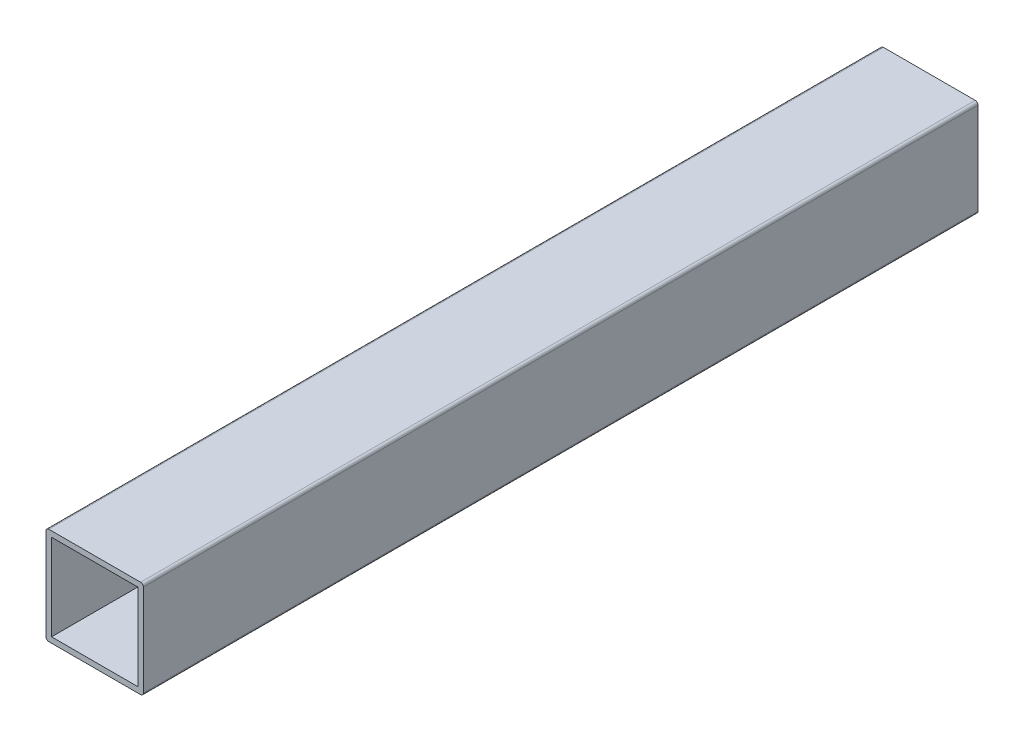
ISO-10303-21;
HEADER;
FILE_DESCRIPTION(('STEP AP214'),'2;1');
FILE_NAME('part.step','',(''),(''),'','','');
FILE_SCHEMA(('AUTOMOTIVE_DESIGN { 1 0 10303 214 1 1 1 1 }'));
ENDSEC;
DATA;
#1=APPLICATION_CONTEXT('core data for automotive mechanical design processes');
#2=APPLICATION_PROTOCOL_DEFINITION('international standard','automotive_design',2000,#1);
#3=PRODUCT_CONTEXT('',#1,'mechanical');
#4=PRODUCT('Part','Part','',(#3));
#5=PRODUCT_RELATED_PRODUCT_CATEGORY('part','',(#4));
#6=PRODUCT_DEFINITION_FORMATION('','',#4);
#7=PRODUCT_DEFINITION_CONTEXT('part definition',#1,'design');
#8=PRODUCT_DEFINITION('design','',#6,#7);
#9=PRODUCT_DEFINITION_SHAPE('','',#8);
#10=(LENGTH_UNIT() NAMED_UNIT(*) SI_UNIT(.MILLI.,.METRE.));
#11=(NAMED_UNIT(*) PLANE_ANGLE_UNIT() SI_UNIT($,.RADIAN.));
#12=(NAMED_UNIT(*) SI_UNIT($,.STERADIAN.) SOLID_ANGLE_UNIT());
#13=UNCERTAINTY_MEASURE_WITH_UNIT(LENGTH_MEASURE(1.E-05),#10,'distance_accuracy_value','');
#14=(GEOMETRIC_REPRESENTATION_CONTEXT(3) GLOBAL_UNCERTAINTY_ASSIGNED_CONTEXT((#13)) GLOBAL_UNIT_ASSIGNED_CONTEXT((#10,
#11,#12)) REPRESENTATION_CONTEXT('',''));
#15=CARTESIAN_POINT('',(0.,0.,0.));
#16=DIRECTION('',(0.,0.,1.));
#17=DIRECTION('',(1.,0.,0.));
#18=AXIS2_PLACEMENT_3D('',#15,#16,#17);
#19=CARTESIAN_POINT('',(-16.5,-16.5,300.));
#20=DIRECTION('',(0.,0.,-1.));
#21=DIRECTION('',(-1.,0.,0.));
#22=AXIS2_PLACEMENT_3D('',#19,#20,#21);
#23=PLANE('',#22);
#24=CARTESIAN_POINT('',(-16.5,-16.5,300.));
#25=DIRECTION('',(0.,0.,-1.));
#26=DIRECTION('',(-1.,0.,0.));
#27=AXIS2_PLACEMENT_3D('',#24,#25,#26);
#28=CIRCLE('',#27,0.99999999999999);
#29=CARTESIAN_POINT('',(-16.5,-17.5,300.));
#30=VERTEX_POINT('',#29);
#31=CARTESIAN_POINT('',(-17.5,-16.5,300.));
#32=VERTEX_POINT('',#31);
#33=EDGE_CURVE('E178',#30,#32,#28,.T.);
#34=ORIENTED_EDGE('',*,*,#33,.F.);
#35=DIRECTION('',(-1.,0.,0.));
#36=VECTOR('',#35,1.);
#37=CARTESIAN_POINT('',(16.5,-17.5,300.));
#38=LINE('',#37,#36);
#39=CARTESIAN_POINT('',(16.5,-17.5,300.));
#40=VERTEX_POINT('',#39);
#41=EDGE_CURVE('E199',#40,#30,#38,.T.);
#42=ORIENTED_EDGE('',*,*,#41,.F.);
#43=CARTESIAN_POINT('',(16.5,-16.5,300.));
#44=DIRECTION('',(0.,0.,-1.));
#45=DIRECTION('',(-1.,0.,0.));
#46=AXIS2_PLACEMENT_3D('',#43,#44,#45);
#47=CIRCLE('',#46,1.);
#48=CARTESIAN_POINT('',(17.5,-16.5,300.));
#49=VERTEX_POINT('',#48);
#50=EDGE_CURVE('E196',#49,#40,#47,.T.);
#51=ORIENTED_EDGE('',*,*,#50,.F.);
#52=DIRECTION('',(0.,1.,0.));
#53=VECTOR('',#52,1.);
#54=CARTESIAN_POINT('',(17.5,-16.5,300.));
#55=LINE('',#54,#53);
#56=CARTESIAN_POINT('',(17.5,16.5,300.));
#57=VERTEX_POINT('',#56);
#58=EDGE_CURVE('E193',#49,#57,#55,.T.);
#59=ORIENTED_EDGE('',*,*,#58,.T.);
#60=CARTESIAN_POINT('',(16.5,16.5,300.));
#61=DIRECTION('',(0.,0.,1.));
#62=DIRECTION('',(1.,0.,0.));
#63=AXIS2_PLACEMENT_3D('',#60,#61,#62);
#64=CIRCLE('',#63,0.999999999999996);
#65=CARTESIAN_POINT('',(16.5,17.5,300.));
#66=VERTEX_POINT('',#65);
#67=EDGE_CURVE('E190',#57,#66,#64,.T.);
#68=ORIENTED_EDGE('',*,*,#67,.T.);
#69=DIRECTION('',(1.,0.,0.));
#70=VECTOR('',#69,1.);
#71=CARTESIAN_POINT('',(-16.5,17.5,300.));
#72=LINE('',#71,#70);
#73=CARTESIAN_POINT('',(-16.5,17.5,300.));
#74=VERTEX_POINT('',#73);
#75=EDGE_CURVE('E187',#74,#66,#72,.T.);
#76=ORIENTED_EDGE('',*,*,#75,.F.);
#77=CARTESIAN_POINT('',(-16.5,16.5,300.));
#78=DIRECTION('',(0.,0.,-1.));
#79=DIRECTION('',(-1.,0.,0.));
#80=AXIS2_PLACEMENT_3D('',#77,#78,#79);
#81=CIRCLE('',#80,0.999999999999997);
#82=CARTESIAN_POINT('',(-17.5,16.5,300.));
#83=VERTEX_POINT('',#82);
#84=EDGE_CURVE('E184',#83,#74,#81,.T.);
#85=ORIENTED_EDGE('',*,*,#84,.F.);
#86=DIRECTION('',(0.,-1.,0.));
#87=VECTOR('',#86,1.);
#88=CARTESIAN_POINT('',(-17.5,16.5,300.));
#89=LINE('',#88,#87);
#90=EDGE_CURVE('E181',#83,#32,#89,.T.);
#91=ORIENTED_EDGE('',*,*,#90,.T.);
#92=EDGE_LOOP('',(#34,#42,#51,#59,#68,#76,#85,#91));
#93=FACE_BOUND('',#92,.T.);
#94=DIRECTION('',(0.,-1.,0.));
#95=VECTOR('',#94,1.);
#96=CARTESIAN_POINT('',(-15.5,-16.5,300.));
#97=LINE('',#96,#95);
#98=CARTESIAN_POINT('',(-15.5,15.5,300.));
#99=VERTEX_POINT('',#98);
#100=CARTESIAN_POINT('',(-15.5,-15.5,300.));
#101=VERTEX_POINT('',#100);
#102=EDGE_CURVE('E120',#99,#101,#97,.T.);
#103=ORIENTED_EDGE('',*,*,#102,.F.);
#104=DIRECTION('',(1.,0.,0.));
#105=VECTOR('',#104,1.);
#106=CARTESIAN_POINT('',(-16.5,15.5,300.));
#107=LINE('',#106,#105);
#108=CARTESIAN_POINT('',(15.5,15.5,300.));
#109=VERTEX_POINT('',#108);
#110=EDGE_CURVE('E147',#99,#109,#107,.T.);
#111=ORIENTED_EDGE('',*,*,#110,.T.);
#112=DIRECTION('',(0.,1.,0.));
#113=VECTOR('',#112,1.);
#114=CARTESIAN_POINT('',(15.5,-16.5,300.));
#115=LINE('',#114,#113);
#116=CARTESIAN_POINT('',(15.5,-15.5,300.));
#117=VERTEX_POINT('',#116);
#118=EDGE_CURVE('E45',#117,#109,#115,.T.);
#119=ORIENTED_EDGE('',*,*,#118,.F.);
#120=DIRECTION('',(-1.,0.,0.));
#121=VECTOR('',#120,1.);
#122=CARTESIAN_POINT('',(-16.5,-15.5,300.));
#123=LINE('',#122,#121);
#124=EDGE_CURVE('E144',#117,#101,#123,.T.);
#125=ORIENTED_EDGE('',*,*,#124,.T.);
#126=EDGE_LOOP('',(#103,#111,#119,#125));
#127=FACE_BOUND('',#126,.T.);
#128=ADVANCED_FACE('F30',(#93,#127),#23,.F.);
#129=CARTESIAN_POINT('',(-16.5,-16.5,0.));
#130=DIRECTION('',(0.,0.,-1.));
#131=DIRECTION('',(-1.,0.,0.));
#132=AXIS2_PLACEMENT_3D('',#129,#130,#131);
#133=PLANE('',#132);
#134=CARTESIAN_POINT('',(-16.5,-16.5,0.));
#135=DIRECTION('',(0.,0.,-1.));
#136=DIRECTION('',(-1.,0.,0.));
#137=AXIS2_PLACEMENT_3D('',#134,#135,#136);
#138=CIRCLE('',#137,0.99999999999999);
#139=CARTESIAN_POINT('',(-16.5,-17.5,0.));
#140=VERTEX_POINT('',#139);
#141=CARTESIAN_POINT('',(-17.5,-16.5,0.));
#142=VERTEX_POINT('',#141);
#143=EDGE_CURVE('E124',#140,#142,#138,.T.);
#144=ORIENTED_EDGE('',*,*,#143,.T.);
#145=DIRECTION('',(0.,-1.,0.));
#146=VECTOR('',#145,1.);
#147=CARTESIAN_POINT('',(-17.5,16.5,0.));
#148=LINE('',#147,#146);
#149=CARTESIAN_POINT('',(-17.5,16.5,0.));
#150=VERTEX_POINT('',#149);
#151=EDGE_CURVE('E157',#150,#142,#148,.T.);
#152=ORIENTED_EDGE('',*,*,#151,.F.);
#153=CARTESIAN_POINT('',(-16.5,16.5,0.));
#154=DIRECTION('',(0.,0.,-1.));
#155=DIRECTION('',(-1.,0.,0.));
#156=AXIS2_PLACEMENT_3D('',#153,#154,#155);
#157=CIRCLE('',#156,0.999999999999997);
#158=CARTESIAN_POINT('',(-16.5,17.5,0.));
#159=VERTEX_POINT('',#158);
#160=EDGE_CURVE('E160',#150,#159,#157,.T.);
#161=ORIENTED_EDGE('',*,*,#160,.T.);
#162=DIRECTION('',(1.,0.,0.));
#163=VECTOR('',#162,1.);
#164=CARTESIAN_POINT('',(-16.5,17.5,0.));
#165=LINE('',#164,#163);
#166=CARTESIAN_POINT('',(16.5,17.5,0.));
#167=VERTEX_POINT('',#166);
#168=EDGE_CURVE('E163',#159,#167,#165,.T.);
#169=ORIENTED_EDGE('',*,*,#168,.T.);
#170=CARTESIAN_POINT('',(16.5,16.5,0.));
#171=DIRECTION('',(0.,0.,1.));
#172=DIRECTION('',(1.,0.,0.));
#173=AXIS2_PLACEMENT_3D('',#170,#171,#172);
#174=CIRCLE('',#173,0.999999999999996);
#175=CARTESIAN_POINT('',(17.5,16.5,0.));
#176=VERTEX_POINT('',#175);
#177=EDGE_CURVE('E166',#176,#167,#174,.T.);
#178=ORIENTED_EDGE('',*,*,#177,.F.);
#179=DIRECTION('',(0.,1.,0.));
#180=VECTOR('',#179,1.);
#181=CARTESIAN_POINT('',(17.5,-16.5,0.));
#182=LINE('',#181,#180);
#183=CARTESIAN_POINT('',(17.5,-16.5,0.));
#184=VERTEX_POINT('',#183);
#185=EDGE_CURVE('E169',#184,#176,#182,.T.);
#186=ORIENTED_EDGE('',*,*,#185,.F.);
#187=CARTESIAN_POINT('',(16.5,-16.5,0.));
#188=DIRECTION('',(0.,0.,-1.));
#189=DIRECTION('',(-1.,0.,0.));
#190=AXIS2_PLACEMENT_3D('',#187,#188,#189);
#191=CIRCLE('',#190,1.);
#192=CARTESIAN_POINT('',(16.5,-17.5,0.));
#193=VERTEX_POINT('',#192);
#194=EDGE_CURVE('E172',#184,#193,#191,.T.);
#195=ORIENTED_EDGE('',*,*,#194,.T.);
#196=DIRECTION('',(-1.,0.,0.));
#197=VECTOR('',#196,1.);
#198=CARTESIAN_POINT('',(16.5,-17.5,0.));
#199=LINE('',#198,#197);
#200=EDGE_CURVE('E175',#193,#140,#199,.T.);
#201=ORIENTED_EDGE('',*,*,#200,.T.);
#202=EDGE_LOOP('',(#144,#152,#161,#169,#178,#186,#195,#201));
#203=FACE_BOUND('',#202,.T.);
#204=DIRECTION('',(1.,0.,0.));
#205=VECTOR('',#204,1.);
#206=CARTESIAN_POINT('',(-16.5,15.5,0.));
#207=LINE('',#206,#205);
#208=CARTESIAN_POINT('',(-15.5,15.5,0.));
#209=VERTEX_POINT('',#208);
#210=CARTESIAN_POINT('',(15.5,15.5,0.));
#211=VERTEX_POINT('',#210);
#212=EDGE_CURVE('E138',#209,#211,#207,.T.);
#213=ORIENTED_EDGE('',*,*,#212,.F.);
#214=DIRECTION('',(0.,-1.,0.));
#215=VECTOR('',#214,1.);
#216=CARTESIAN_POINT('',(-15.5,-16.5,0.));
#217=LINE('',#216,#215);
#218=CARTESIAN_POINT('',(-15.5,-15.5,0.));
#219=VERTEX_POINT('',#218);
#220=EDGE_CURVE('E53',#209,#219,#217,.T.);
#221=ORIENTED_EDGE('',*,*,#220,.T.);
#222=DIRECTION('',(-1.,0.,0.));
#223=VECTOR('',#222,1.);
#224=CARTESIAN_POINT('',(-16.5,-15.5,0.));
#225=LINE('',#224,#223);
#226=CARTESIAN_POINT('',(15.5,-15.5,0.));
#227=VERTEX_POINT('',#226);
#228=EDGE_CURVE('E128',#227,#219,#225,.T.);
#229=ORIENTED_EDGE('',*,*,#228,.F.);
#230=DIRECTION('',(0.,1.,0.));
#231=VECTOR('',#230,1.);
#232=CARTESIAN_POINT('',(15.5,-16.5,0.));
#233=LINE('',#232,#231);
#234=EDGE_CURVE('E133',#227,#211,#233,.T.);
#235=ORIENTED_EDGE('',*,*,#234,.T.);
#236=EDGE_LOOP('',(#213,#221,#229,#235));
#237=FACE_BOUND('',#236,.T.);
#238=ADVANCED_FACE('F136',(#203,#237),#133,.T.);
#239=CARTESIAN_POINT('',(-16.5,-16.5,300.));
#240=DIRECTION('',(0.,0.,-1.));
#241=DIRECTION('',(-1.,0.,0.));
#242=AXIS2_PLACEMENT_3D('',#239,#240,#241);
#243=CYLINDRICAL_SURFACE('',#242,0.99999999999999);
#244=DIRECTION('',(0.,0.,-1.));
#245=VECTOR('',#244,1.);
#246=CARTESIAN_POINT('',(-16.5,-17.5,300.));
#247=LINE('',#246,#245);
#248=EDGE_CURVE('E11',#30,#140,#247,.T.);
#249=ORIENTED_EDGE('',*,*,#248,.F.);
#250=ORIENTED_EDGE('',*,*,#33,.T.);
#251=DIRECTION('',(0.,0.,-1.));
#252=VECTOR('',#251,1.);
#253=CARTESIAN_POINT('',(-17.5,-16.5,300.));
#254=LINE('',#253,#252);
#255=EDGE_CURVE('E202',#32,#142,#254,.T.);
#256=ORIENTED_EDGE('',*,*,#255,.T.);
#257=ORIENTED_EDGE('',*,*,#143,.F.);
#258=EDGE_LOOP('',(#249,#250,#256,#257));
#259=FACE_BOUND('',#258,.T.);
#260=ADVANCED_FACE('F226',(#259),#243,.T.);
#261=CARTESIAN_POINT('',(16.5,-17.5,300.));
#262=DIRECTION('',(0.,-1.,0.));
#263=DIRECTION('',(0.,0.,-1.));
#264=AXIS2_PLACEMENT_3D('',#261,#262,#263);
#265=PLANE('',#264);
#266=DIRECTION('',(0.,0.,-1.));
#267=VECTOR('',#266,1.);
#268=CARTESIAN_POINT('',(16.5,-17.5,300.));
#269=LINE('',#268,#267);
#270=EDGE_CURVE('E38',#40,#193,#269,.T.);
#271=ORIENTED_EDGE('',*,*,#270,.F.);
#272=ORIENTED_EDGE('',*,*,#41,.T.);
#273=ORIENTED_EDGE('',*,*,#248,.T.);
#274=ORIENTED_EDGE('',*,*,#200,.F.);
#275=EDGE_LOOP('',(#271,#272,#273,#274));
#276=FACE_BOUND('',#275,.T.);
#277=ADVANCED_FACE('F32',(#276),#265,.T.);
#278=CARTESIAN_POINT('',(16.5,-16.5,300.));
#279=DIRECTION('',(0.,0.,-1.));
#280=DIRECTION('',(-1.,0.,0.));
#281=AXIS2_PLACEMENT_3D('',#278,#279,#280);
#282=CYLINDRICAL_SURFACE('',#281,1.);
#283=DIRECTION('',(0.,0.,-1.));
#284=VECTOR('',#283,1.);
#285=CARTESIAN_POINT('',(17.5,-16.5,300.));
#286=LINE('',#285,#284);
#287=EDGE_CURVE('E212',#49,#184,#286,.T.);
#288=ORIENTED_EDGE('',*,*,#287,.F.);
#289=ORIENTED_EDGE('',*,*,#50,.T.);
#290=ORIENTED_EDGE('',*,*,#270,.T.);
#291=ORIENTED_EDGE('',*,*,#194,.F.);
#292=EDGE_LOOP('',(#288,#289,#290,#291));
#293=FACE_BOUND('',#292,.T.);
#294=ADVANCED_FACE('F215',(#293),#282,.T.);
#295=CARTESIAN_POINT('',(17.5,-16.5,300.));
#296=DIRECTION('',(-1.,0.,0.));
#297=DIRECTION('',(0.,-1.,0.));
#298=AXIS2_PLACEMENT_3D('',#295,#296,#297);
#299=PLANE('',#298);
#300=DIRECTION('',(0.,0.,-1.));
#301=VECTOR('',#300,1.);
#302=CARTESIAN_POINT('',(17.5,16.5,300.));
#303=LINE('',#302,#301);
#304=EDGE_CURVE('E210',#57,#176,#303,.T.);
#305=ORIENTED_EDGE('',*,*,#304,.F.);
#306=ORIENTED_EDGE('',*,*,#58,.F.);
#307=ORIENTED_EDGE('',*,*,#287,.T.);
#308=ORIENTED_EDGE('',*,*,#185,.T.);
#309=EDGE_LOOP('',(#305,#306,#307,#308));
#310=FACE_BOUND('',#309,.T.);
#311=ADVANCED_FACE('F243',(#310),#299,.F.);
#312=CARTESIAN_POINT('',(16.5,16.5,300.));
#313=DIRECTION('',(0.,0.,-1.));
#314=DIRECTION('',(-1.,0.,0.));
#315=AXIS2_PLACEMENT_3D('',#312,#313,#314);
#316=CYLINDRICAL_SURFACE('',#315,0.999999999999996);
#317=DIRECTION('',(0.,0.,-1.));
#318=VECTOR('',#317,1.);
#319=CARTESIAN_POINT('',(16.5,17.5,300.));
#320=LINE('',#319,#318);
#321=EDGE_CURVE('E208',#66,#167,#320,.T.);
#322=ORIENTED_EDGE('',*,*,#321,.F.);
#323=ORIENTED_EDGE('',*,*,#67,.F.);
#324=ORIENTED_EDGE('',*,*,#304,.T.);
#325=ORIENTED_EDGE('',*,*,#177,.T.);
#326=EDGE_LOOP('',(#322,#323,#324,#325));
#327=FACE_BOUND('',#326,.T.);
#328=ADVANCED_FACE('F241',(#327),#316,.T.);
#329=CARTESIAN_POINT('',(-16.5,17.5,300.));
#330=DIRECTION('',(0.,1.,0.));
#331=DIRECTION('',(0.,0.,1.));
#332=AXIS2_PLACEMENT_3D('',#329,#330,#331);
#333=PLANE('',#332);
#334=DIRECTION('',(0.,0.,-1.));
#335=VECTOR('',#334,1.);
#336=CARTESIAN_POINT('',(-16.5,17.5,300.));
#337=LINE('',#336,#335);
#338=EDGE_CURVE('E206',#74,#159,#337,.T.);
#339=ORIENTED_EDGE('',*,*,#338,.F.);
#340=ORIENTED_EDGE('',*,*,#75,.T.);
#341=ORIENTED_EDGE('',*,*,#321,.T.);
#342=ORIENTED_EDGE('',*,*,#168,.F.);
#343=EDGE_LOOP('',(#339,#340,#341,#342));
#344=FACE_BOUND('',#343,.T.);
#345=ADVANCED_FACE('F238',(#344),#333,.T.);
#346=CARTESIAN_POINT('',(-16.5,16.5,300.));
#347=DIRECTION('',(0.,0.,-1.));
#348=DIRECTION('',(-1.,0.,0.));
#349=AXIS2_PLACEMENT_3D('',#346,#347,#348);
#350=CYLINDRICAL_SURFACE('',#349,0.999999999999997);
#351=DIRECTION('',(0.,0.,-1.));
#352=VECTOR('',#351,1.);
#353=CARTESIAN_POINT('',(-17.5,16.5,300.));
#354=LINE('',#353,#352);
#355=EDGE_CURVE('E204',#83,#150,#354,.T.);
#356=ORIENTED_EDGE('',*,*,#355,.F.);
#357=ORIENTED_EDGE('',*,*,#84,.T.);
#358=ORIENTED_EDGE('',*,*,#338,.T.);
#359=ORIENTED_EDGE('',*,*,#160,.F.);
#360=EDGE_LOOP('',(#356,#357,#358,#359));
#361=FACE_BOUND('',#360,.T.);
#362=ADVANCED_FACE('F234',(#361),#350,.T.);
#363=CARTESIAN_POINT('',(-17.5,16.5,300.));
#364=DIRECTION('',(1.,0.,0.));
#365=DIRECTION('',(0.,1.,0.));
#366=AXIS2_PLACEMENT_3D('',#363,#364,#365);
#367=PLANE('',#366);
#368=ORIENTED_EDGE('',*,*,#90,.F.);
#369=ORIENTED_EDGE('',*,*,#355,.T.);
#370=ORIENTED_EDGE('',*,*,#151,.T.);
#371=ORIENTED_EDGE('',*,*,#255,.F.);
#372=EDGE_LOOP('',(#368,#369,#370,#371));
#373=FACE_BOUND('',#372,.T.);
#374=ADVANCED_FACE('F231',(#373),#367,.F.);
#375=CARTESIAN_POINT('',(-15.5,-16.5,300.));
#376=DIRECTION('',(1.,0.,0.));
#377=DIRECTION('',(0.,1.,0.));
#378=AXIS2_PLACEMENT_3D('',#375,#376,#377);
#379=PLANE('',#378);
#380=DIRECTION('',(0.,0.,-1.));
#381=VECTOR('',#380,1.);
#382=CARTESIAN_POINT('',(-15.5,-15.5,300.));
#383=LINE('',#382,#381);
#384=EDGE_CURVE('E116',#101,#219,#383,.T.);
#385=ORIENTED_EDGE('',*,*,#384,.T.);
#386=ORIENTED_EDGE('',*,*,#220,.F.);
#387=DIRECTION('',(0.,0.,-1.));
#388=VECTOR('',#387,1.);
#389=CARTESIAN_POINT('',(-15.5,15.5,300.));
#390=LINE('',#389,#388);
#391=EDGE_CURVE('E150',#99,#209,#390,.T.);
#392=ORIENTED_EDGE('',*,*,#391,.F.);
#393=ORIENTED_EDGE('',*,*,#102,.T.);
#394=EDGE_LOOP('',(#385,#386,#392,#393));
#395=FACE_BOUND('',#394,.T.);
#396=ADVANCED_FACE('F118',(#395),#379,.T.);
#397=CARTESIAN_POINT('',(-16.5,-15.5,300.));
#398=DIRECTION('',(0.,-1.,0.));
#399=DIRECTION('',(0.,0.,-1.));
#400=AXIS2_PLACEMENT_3D('',#397,#398,#399);
#401=PLANE('',#400);
#402=DIRECTION('',(0.,0.,-1.));
#403=VECTOR('',#402,1.);
#404=CARTESIAN_POINT('',(15.5,-15.5,300.));
#405=LINE('',#404,#403);
#406=EDGE_CURVE('E125',#117,#227,#405,.T.);
#407=ORIENTED_EDGE('',*,*,#406,.T.);
#408=ORIENTED_EDGE('',*,*,#228,.T.);
#409=ORIENTED_EDGE('',*,*,#384,.F.);
#410=ORIENTED_EDGE('',*,*,#124,.F.);
#411=EDGE_LOOP('',(#407,#408,#409,#410));
#412=FACE_BOUND('',#411,.T.);
#413=ADVANCED_FACE('F129',(#412),#401,.F.);
#414=CARTESIAN_POINT('',(15.5,-16.5,300.));
#415=DIRECTION('',(-1.,0.,0.));
#416=DIRECTION('',(0.,-1.,0.));
#417=AXIS2_PLACEMENT_3D('',#414,#415,#416);
#418=PLANE('',#417);
#419=DIRECTION('',(0.,0.,-1.));
#420=VECTOR('',#419,1.);
#421=CARTESIAN_POINT('',(15.5,15.5,300.));
#422=LINE('',#421,#420);
#423=EDGE_CURVE('E152',#109,#211,#422,.T.);
#424=ORIENTED_EDGE('',*,*,#423,.T.);
#425=ORIENTED_EDGE('',*,*,#234,.F.);
#426=ORIENTED_EDGE('',*,*,#406,.F.);
#427=ORIENTED_EDGE('',*,*,#118,.T.);
#428=EDGE_LOOP('',(#424,#425,#426,#427));
#429=FACE_BOUND('',#428,.T.);
#430=ADVANCED_FACE('F252',(#429),#418,.T.);
#431=CARTESIAN_POINT('',(-16.5,15.5,300.));
#432=DIRECTION('',(0.,1.,0.));
#433=DIRECTION('',(0.,0.,1.));
#434=AXIS2_PLACEMENT_3D('',#431,#432,#433);
#435=PLANE('',#434);
#436=ORIENTED_EDGE('',*,*,#110,.F.);
#437=ORIENTED_EDGE('',*,*,#391,.T.);
#438=ORIENTED_EDGE('',*,*,#212,.T.);
#439=ORIENTED_EDGE('',*,*,#423,.F.);
#440=EDGE_LOOP('',(#436,#437,#438,#439));
#441=FACE_BOUND('',#440,.T.);
#442=ADVANCED_FACE('F251',(#441),#435,.F.);
#443=CLOSED_SHELL('',(#128,#238,#260,#277,#294,#311,#328,#345,#362,#374,#396,#413,#430,#442));
#444=MANIFOLD_SOLID_BREP('B2',#443);
#445=ADVANCED_BREP_SHAPE_REPRESENTATION('',(#18,#444),#14);
#446=SHAPE_DEFINITION_REPRESENTATION(#9,#445);
ENDSEC;
END-ISO-10303-21;
